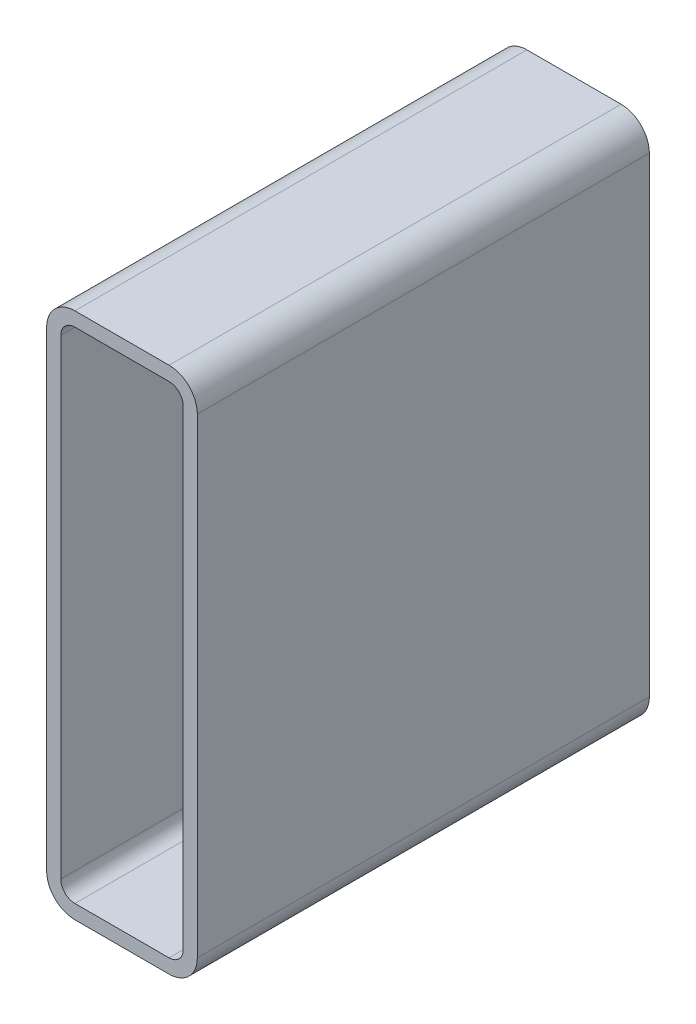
ISO-10303-21;
HEADER;
FILE_DESCRIPTION(('STEP AP214'),'2;1');
FILE_NAME('part.step','',(''),(''),'','','');
FILE_SCHEMA(('AUTOMOTIVE_DESIGN { 1 0 10303 214 1 1 1 1 }'));
ENDSEC;
DATA;
#1=APPLICATION_CONTEXT('core data for automotive mechanical design processes');
#2=APPLICATION_PROTOCOL_DEFINITION('international standard','automotive_design',2000,#1);
#3=PRODUCT_CONTEXT('',#1,'mechanical');
#4=PRODUCT('Part','Part','',(#3));
#5=PRODUCT_RELATED_PRODUCT_CATEGORY('part','',(#4));
#6=PRODUCT_DEFINITION_FORMATION('','',#4);
#7=PRODUCT_DEFINITION_CONTEXT('part definition',#1,'design');
#8=PRODUCT_DEFINITION('design','',#6,#7);
#9=PRODUCT_DEFINITION_SHAPE('','',#8);
#10=(LENGTH_UNIT() NAMED_UNIT(*) SI_UNIT(.MILLI.,.METRE.));
#11=(NAMED_UNIT(*) PLANE_ANGLE_UNIT() SI_UNIT($,.RADIAN.));
#12=(NAMED_UNIT(*) SI_UNIT($,.STERADIAN.) SOLID_ANGLE_UNIT());
#13=UNCERTAINTY_MEASURE_WITH_UNIT(LENGTH_MEASURE(1.E-05),#10,'distance_accuracy_value','');
#14=(GEOMETRIC_REPRESENTATION_CONTEXT(3) GLOBAL_UNCERTAINTY_ASSIGNED_CONTEXT((#13)) GLOBAL_UNIT_ASSIGNED_CONTEXT((#10,
#11,#12)) REPRESENTATION_CONTEXT('',''));
#15=CARTESIAN_POINT('',(0.,0.,0.));
#16=DIRECTION('',(0.,0.,1.));
#17=DIRECTION('',(1.,0.,0.));
#18=AXIS2_PLACEMENT_3D('',#15,#16,#17);
#19=CARTESIAN_POINT('',(20.7251778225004,338.378679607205,304.8));
#20=DIRECTION('',(0.,0.,1.));
#21=DIRECTION('',(1.,0.,0.));
#22=AXIS2_PLACEMENT_3D('',#19,#20,#21);
#23=PLANE('',#22);
#24=CARTESIAN_POINT('',(20.7251778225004,338.378679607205,304.8));
#25=DIRECTION('',(0.,0.,1.));
#26=DIRECTION('',(1.,0.,0.));
#27=AXIS2_PLACEMENT_3D('',#24,#25,#26);
#28=CIRCLE('',#27,19.05);
#29=CARTESIAN_POINT('',(20.7251778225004,357.428679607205,304.8));
#30=VERTEX_POINT('',#29);
#31=CARTESIAN_POINT('',(1.67517782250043,338.378679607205,304.8));
#32=VERTEX_POINT('',#31);
#33=EDGE_CURVE('E211',#30,#32,#28,.T.);
#34=ORIENTED_EDGE('',*,*,#33,.T.);
#35=DIRECTION('',(0.,-1.,0.));
#36=VECTOR('',#35,1.);
#37=CARTESIAN_POINT('',(1.67517782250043,20.8786796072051,304.8));
#38=LINE('',#37,#36);
#39=CARTESIAN_POINT('',(1.67517782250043,20.8786796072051,304.8));
#40=VERTEX_POINT('',#39);
#41=EDGE_CURVE('E214',#32,#40,#38,.T.);
#42=ORIENTED_EDGE('',*,*,#41,.T.);
#43=CARTESIAN_POINT('',(20.7251778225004,20.8786796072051,304.8));
#44=DIRECTION('',(0.,0.,1.));
#45=DIRECTION('',(1.,0.,0.));
#46=AXIS2_PLACEMENT_3D('',#43,#44,#45);
#47=CIRCLE('',#46,19.05);
#48=CARTESIAN_POINT('',(20.7251778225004,1.82867960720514,304.8));
#49=VERTEX_POINT('',#48);
#50=EDGE_CURVE('E217',#40,#49,#47,.T.);
#51=ORIENTED_EDGE('',*,*,#50,.T.);
#52=DIRECTION('',(1.,0.,0.));
#53=VECTOR('',#52,1.);
#54=CARTESIAN_POINT('',(84.2251778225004,1.82867960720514,304.8));
#55=LINE('',#54,#53);
#56=CARTESIAN_POINT('',(84.2251778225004,1.82867960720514,304.8));
#57=VERTEX_POINT('',#56);
#58=EDGE_CURVE('E219',#49,#57,#55,.T.);
#59=ORIENTED_EDGE('',*,*,#58,.T.);
#60=CARTESIAN_POINT('',(84.2251778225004,20.8786796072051,304.8));
#61=DIRECTION('',(0.,0.,1.));
#62=DIRECTION('',(1.,0.,0.));
#63=AXIS2_PLACEMENT_3D('',#60,#61,#62);
#64=CIRCLE('',#63,19.05);
#65=CARTESIAN_POINT('',(103.2751778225,20.8786796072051,304.8));
#66=VERTEX_POINT('',#65);
#67=EDGE_CURVE('E221',#57,#66,#64,.T.);
#68=ORIENTED_EDGE('',*,*,#67,.T.);
#69=DIRECTION('',(0.,1.,0.));
#70=VECTOR('',#69,1.);
#71=CARTESIAN_POINT('',(103.2751778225,338.378679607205,304.8));
#72=LINE('',#71,#70);
#73=CARTESIAN_POINT('',(103.2751778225,338.378679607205,304.8));
#74=VERTEX_POINT('',#73);
#75=EDGE_CURVE('E223',#66,#74,#72,.T.);
#76=ORIENTED_EDGE('',*,*,#75,.T.);
#77=CARTESIAN_POINT('',(84.2251778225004,338.378679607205,304.8));
#78=DIRECTION('',(0.,0.,1.));
#79=DIRECTION('',(1.,0.,0.));
#80=AXIS2_PLACEMENT_3D('',#77,#78,#79);
#81=CIRCLE('',#80,19.05);
#82=CARTESIAN_POINT('',(84.2251778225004,357.428679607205,304.8));
#83=VERTEX_POINT('',#82);
#84=EDGE_CURVE('E225',#74,#83,#81,.T.);
#85=ORIENTED_EDGE('',*,*,#84,.T.);
#86=DIRECTION('',(-1.,0.,0.));
#87=VECTOR('',#86,1.);
#88=CARTESIAN_POINT('',(20.7251778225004,357.428679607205,304.8));
#89=LINE('',#88,#87);
#90=EDGE_CURVE('E227',#83,#30,#89,.T.);
#91=ORIENTED_EDGE('',*,*,#90,.T.);
#92=EDGE_LOOP('',(#34,#42,#51,#59,#68,#76,#85,#91));
#93=FACE_BOUND('',#92,.T.);
#94=DIRECTION('',(0.,-1.,0.));
#95=VECTOR('',#94,1.);
#96=CARTESIAN_POINT('',(11.2001778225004,20.8786796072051,304.8));
#97=LINE('',#96,#95);
#98=CARTESIAN_POINT('',(11.2001778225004,338.378679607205,304.8));
#99=VERTEX_POINT('',#98);
#100=CARTESIAN_POINT('',(11.2001778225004,20.8786796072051,304.8));
#101=VERTEX_POINT('',#100);
#102=EDGE_CURVE('E154',#99,#101,#97,.T.);
#103=ORIENTED_EDGE('',*,*,#102,.F.);
#104=CARTESIAN_POINT('',(20.7251778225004,338.378679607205,304.8));
#105=DIRECTION('',(0.,0.,1.));
#106=DIRECTION('',(1.,0.,0.));
#107=AXIS2_PLACEMENT_3D('',#104,#105,#106);
#108=CIRCLE('',#107,9.52499999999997);
#109=CARTESIAN_POINT('',(20.7251778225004,347.903679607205,304.8));
#110=VERTEX_POINT('',#109);
#111=EDGE_CURVE('E146',#110,#99,#108,.T.);
#112=ORIENTED_EDGE('',*,*,#111,.F.);
#113=DIRECTION('',(-1.,0.,0.));
#114=VECTOR('',#113,1.);
#115=CARTESIAN_POINT('',(20.7251778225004,347.903679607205,304.8));
#116=LINE('',#115,#114);
#117=CARTESIAN_POINT('',(84.2251778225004,347.903679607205,304.8));
#118=VERTEX_POINT('',#117);
#119=EDGE_CURVE('E179',#118,#110,#116,.T.);
#120=ORIENTED_EDGE('',*,*,#119,.F.);
#121=CARTESIAN_POINT('',(84.2251778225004,338.378679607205,304.8));
#122=DIRECTION('',(0.,0.,1.));
#123=DIRECTION('',(1.,0.,0.));
#124=AXIS2_PLACEMENT_3D('',#121,#122,#123);
#125=CIRCLE('',#124,9.52499999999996);
#126=CARTESIAN_POINT('',(93.7501778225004,338.378679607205,304.8));
#127=VERTEX_POINT('',#126);
#128=EDGE_CURVE('E177',#127,#118,#125,.T.);
#129=ORIENTED_EDGE('',*,*,#128,.F.);
#130=DIRECTION('',(0.,1.,0.));
#131=VECTOR('',#130,1.);
#132=CARTESIAN_POINT('',(93.7501778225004,338.378679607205,304.8));
#133=LINE('',#132,#131);
#134=CARTESIAN_POINT('',(93.7501778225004,20.8786796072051,304.8));
#135=VERTEX_POINT('',#134);
#136=EDGE_CURVE('E175',#135,#127,#133,.T.);
#137=ORIENTED_EDGE('',*,*,#136,.F.);
#138=CARTESIAN_POINT('',(84.2251778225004,20.8786796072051,304.8));
#139=DIRECTION('',(0.,0.,1.));
#140=DIRECTION('',(1.,0.,0.));
#141=AXIS2_PLACEMENT_3D('',#138,#139,#140);
#142=CIRCLE('',#141,9.52500000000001);
#143=CARTESIAN_POINT('',(84.2251778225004,11.3536796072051,304.8));
#144=VERTEX_POINT('',#143);
#145=EDGE_CURVE('E173',#144,#135,#142,.T.);
#146=ORIENTED_EDGE('',*,*,#145,.F.);
#147=DIRECTION('',(1.,0.,0.));
#148=VECTOR('',#147,1.);
#149=CARTESIAN_POINT('',(84.2251778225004,11.3536796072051,304.8));
#150=LINE('',#149,#148);
#151=CARTESIAN_POINT('',(20.7251778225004,11.3536796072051,304.8));
#152=VERTEX_POINT('',#151);
#153=EDGE_CURVE('E169',#152,#144,#150,.T.);
#154=ORIENTED_EDGE('',*,*,#153,.F.);
#155=CARTESIAN_POINT('',(20.7251778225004,20.8786796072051,304.8));
#156=DIRECTION('',(0.,0.,1.));
#157=DIRECTION('',(1.,0.,0.));
#158=AXIS2_PLACEMENT_3D('',#155,#156,#157);
#159=CIRCLE('',#158,9.525);
#160=EDGE_CURVE('E167',#101,#152,#159,.T.);
#161=ORIENTED_EDGE('',*,*,#160,.F.);
#162=EDGE_LOOP('',(#103,#112,#120,#129,#137,#146,#154,#161));
#163=FACE_BOUND('',#162,.T.);
#164=ADVANCED_FACE('F33',(#93,#163),#23,.T.);
#165=CARTESIAN_POINT('',(20.7251778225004,338.378679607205,0.));
#166=DIRECTION('',(0.,0.,1.));
#167=DIRECTION('',(1.,0.,0.));
#168=AXIS2_PLACEMENT_3D('',#165,#166,#167);
#169=PLANE('',#168);
#170=CARTESIAN_POINT('',(20.7251778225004,338.378679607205,0.));
#171=DIRECTION('',(0.,0.,1.));
#172=DIRECTION('',(1.,0.,0.));
#173=AXIS2_PLACEMENT_3D('',#170,#171,#172);
#174=CIRCLE('',#173,19.05);
#175=CARTESIAN_POINT('',(20.7251778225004,357.428679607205,0.));
#176=VERTEX_POINT('',#175);
#177=CARTESIAN_POINT('',(1.67517782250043,338.378679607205,0.));
#178=VERTEX_POINT('',#177);
#179=EDGE_CURVE('E162',#176,#178,#174,.T.);
#180=ORIENTED_EDGE('',*,*,#179,.F.);
#181=DIRECTION('',(-1.,0.,0.));
#182=VECTOR('',#181,1.);
#183=CARTESIAN_POINT('',(20.7251778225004,357.428679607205,0.));
#184=LINE('',#183,#182);
#185=CARTESIAN_POINT('',(84.2251778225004,357.428679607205,0.));
#186=VERTEX_POINT('',#185);
#187=EDGE_CURVE('E215',#186,#176,#184,.T.);
#188=ORIENTED_EDGE('',*,*,#187,.F.);
#189=CARTESIAN_POINT('',(84.2251778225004,338.378679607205,0.));
#190=DIRECTION('',(0.,0.,1.));
#191=DIRECTION('',(1.,0.,0.));
#192=AXIS2_PLACEMENT_3D('',#189,#190,#191);
#193=CIRCLE('',#192,19.05);
#194=CARTESIAN_POINT('',(103.2751778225,338.378679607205,0.));
#195=VERTEX_POINT('',#194);
#196=EDGE_CURVE('E242',#195,#186,#193,.T.);
#197=ORIENTED_EDGE('',*,*,#196,.F.);
#198=DIRECTION('',(0.,1.,0.));
#199=VECTOR('',#198,1.);
#200=CARTESIAN_POINT('',(103.2751778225,338.378679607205,0.));
#201=LINE('',#200,#199);
#202=CARTESIAN_POINT('',(103.2751778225,20.8786796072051,0.));
#203=VERTEX_POINT('',#202);
#204=EDGE_CURVE('E240',#203,#195,#201,.T.);
#205=ORIENTED_EDGE('',*,*,#204,.F.);
#206=CARTESIAN_POINT('',(84.2251778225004,20.8786796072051,0.));
#207=DIRECTION('',(0.,0.,1.));
#208=DIRECTION('',(1.,0.,0.));
#209=AXIS2_PLACEMENT_3D('',#206,#207,#208);
#210=CIRCLE('',#209,19.05);
#211=CARTESIAN_POINT('',(84.2251778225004,1.82867960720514,0.));
#212=VERTEX_POINT('',#211);
#213=EDGE_CURVE('E238',#212,#203,#210,.T.);
#214=ORIENTED_EDGE('',*,*,#213,.F.);
#215=DIRECTION('',(1.,0.,0.));
#216=VECTOR('',#215,1.);
#217=CARTESIAN_POINT('',(84.2251778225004,1.82867960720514,0.));
#218=LINE('',#217,#216);
#219=CARTESIAN_POINT('',(20.7251778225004,1.82867960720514,0.));
#220=VERTEX_POINT('',#219);
#221=EDGE_CURVE('E236',#220,#212,#218,.T.);
#222=ORIENTED_EDGE('',*,*,#221,.F.);
#223=CARTESIAN_POINT('',(20.7251778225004,20.8786796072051,0.));
#224=DIRECTION('',(0.,0.,1.));
#225=DIRECTION('',(1.,0.,0.));
#226=AXIS2_PLACEMENT_3D('',#223,#224,#225);
#227=CIRCLE('',#226,19.05);
#228=CARTESIAN_POINT('',(1.67517782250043,20.8786796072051,0.));
#229=VERTEX_POINT('',#228);
#230=EDGE_CURVE('E234',#229,#220,#227,.T.);
#231=ORIENTED_EDGE('',*,*,#230,.F.);
#232=DIRECTION('',(0.,-1.,0.));
#233=VECTOR('',#232,1.);
#234=CARTESIAN_POINT('',(1.67517782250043,20.8786796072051,0.));
#235=LINE('',#234,#233);
#236=EDGE_CURVE('E232',#178,#229,#235,.T.);
#237=ORIENTED_EDGE('',*,*,#236,.F.);
#238=EDGE_LOOP('',(#180,#188,#197,#205,#214,#222,#231,#237));
#239=FACE_BOUND('',#238,.T.);
#240=CARTESIAN_POINT('',(20.7251778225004,338.378679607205,0.));
#241=DIRECTION('',(0.,0.,1.));
#242=DIRECTION('',(1.,0.,0.));
#243=AXIS2_PLACEMENT_3D('',#240,#241,#242);
#244=CIRCLE('',#243,9.52499999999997);
#245=CARTESIAN_POINT('',(20.7251778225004,347.903679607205,0.));
#246=VERTEX_POINT('',#245);
#247=CARTESIAN_POINT('',(11.2001778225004,338.378679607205,0.));
#248=VERTEX_POINT('',#247);
#249=EDGE_CURVE('E56',#246,#248,#244,.T.);
#250=ORIENTED_EDGE('',*,*,#249,.T.);
#251=DIRECTION('',(0.,-1.,0.));
#252=VECTOR('',#251,1.);
#253=CARTESIAN_POINT('',(11.2001778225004,20.8786796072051,0.));
#254=LINE('',#253,#252);
#255=CARTESIAN_POINT('',(11.2001778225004,20.8786796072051,0.));
#256=VERTEX_POINT('',#255);
#257=EDGE_CURVE('E161',#248,#256,#254,.T.);
#258=ORIENTED_EDGE('',*,*,#257,.T.);
#259=CARTESIAN_POINT('',(20.7251778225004,20.8786796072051,0.));
#260=DIRECTION('',(0.,0.,1.));
#261=DIRECTION('',(1.,0.,0.));
#262=AXIS2_PLACEMENT_3D('',#259,#260,#261);
#263=CIRCLE('',#262,9.525);
#264=CARTESIAN_POINT('',(20.7251778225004,11.3536796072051,0.));
#265=VERTEX_POINT('',#264);
#266=EDGE_CURVE('E183',#256,#265,#263,.T.);
#267=ORIENTED_EDGE('',*,*,#266,.T.);
#268=DIRECTION('',(1.,0.,0.));
#269=VECTOR('',#268,1.);
#270=CARTESIAN_POINT('',(84.2251778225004,11.3536796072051,0.));
#271=LINE('',#270,#269);
#272=CARTESIAN_POINT('',(84.2251778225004,11.3536796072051,0.));
#273=VERTEX_POINT('',#272);
#274=EDGE_CURVE('E186',#265,#273,#271,.T.);
#275=ORIENTED_EDGE('',*,*,#274,.T.);
#276=CARTESIAN_POINT('',(84.2251778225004,20.8786796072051,0.));
#277=DIRECTION('',(0.,0.,1.));
#278=DIRECTION('',(1.,0.,0.));
#279=AXIS2_PLACEMENT_3D('',#276,#277,#278);
#280=CIRCLE('',#279,9.52500000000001);
#281=CARTESIAN_POINT('',(93.7501778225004,20.8786796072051,0.));
#282=VERTEX_POINT('',#281);
#283=EDGE_CURVE('E189',#273,#282,#280,.T.);
#284=ORIENTED_EDGE('',*,*,#283,.T.);
#285=DIRECTION('',(0.,1.,0.));
#286=VECTOR('',#285,1.);
#287=CARTESIAN_POINT('',(93.7501778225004,338.378679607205,0.));
#288=LINE('',#287,#286);
#289=CARTESIAN_POINT('',(93.7501778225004,338.378679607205,0.));
#290=VERTEX_POINT('',#289);
#291=EDGE_CURVE('E192',#282,#290,#288,.T.);
#292=ORIENTED_EDGE('',*,*,#291,.T.);
#293=CARTESIAN_POINT('',(84.2251778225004,338.378679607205,0.));
#294=DIRECTION('',(0.,0.,1.));
#295=DIRECTION('',(1.,0.,0.));
#296=AXIS2_PLACEMENT_3D('',#293,#294,#295);
#297=CIRCLE('',#296,9.52499999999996);
#298=CARTESIAN_POINT('',(84.2251778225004,347.903679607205,0.));
#299=VERTEX_POINT('',#298);
#300=EDGE_CURVE('E195',#290,#299,#297,.T.);
#301=ORIENTED_EDGE('',*,*,#300,.T.);
#302=DIRECTION('',(-1.,0.,0.));
#303=VECTOR('',#302,1.);
#304=CARTESIAN_POINT('',(20.7251778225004,347.903679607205,0.));
#305=LINE('',#304,#303);
#306=EDGE_CURVE('E155',#299,#246,#305,.T.);
#307=ORIENTED_EDGE('',*,*,#306,.T.);
#308=EDGE_LOOP('',(#250,#258,#267,#275,#284,#292,#301,#307));
#309=FACE_BOUND('',#308,.T.);
#310=ADVANCED_FACE('F272',(#239,#309),#169,.F.);
#311=CARTESIAN_POINT('',(20.7251778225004,338.378679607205,304.8));
#312=DIRECTION('',(0.,0.,-1.));
#313=DIRECTION('',(-1.,0.,0.));
#314=AXIS2_PLACEMENT_3D('',#311,#312,#313);
#315=CYLINDRICAL_SURFACE('',#314,19.05);
#316=ORIENTED_EDGE('',*,*,#179,.T.);
#317=DIRECTION('',(0.,0.,-1.));
#318=VECTOR('',#317,1.);
#319=CARTESIAN_POINT('',(1.67517782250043,338.378679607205,304.8));
#320=LINE('',#319,#318);
#321=EDGE_CURVE('E11',#32,#178,#320,.T.);
#322=ORIENTED_EDGE('',*,*,#321,.F.);
#323=ORIENTED_EDGE('',*,*,#33,.F.);
#324=DIRECTION('',(0.,0.,-1.));
#325=VECTOR('',#324,1.);
#326=CARTESIAN_POINT('',(20.7251778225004,357.428679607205,304.8));
#327=LINE('',#326,#325);
#328=EDGE_CURVE('E229',#30,#176,#327,.T.);
#329=ORIENTED_EDGE('',*,*,#328,.T.);
#330=EDGE_LOOP('',(#316,#322,#323,#329));
#331=FACE_BOUND('',#330,.T.);
#332=ADVANCED_FACE('F35',(#331),#315,.T.);
#333=CARTESIAN_POINT('',(1.67517782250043,20.8786796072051,304.8));
#334=DIRECTION('',(1.,0.,0.));
#335=DIRECTION('',(0.,0.,-1.));
#336=AXIS2_PLACEMENT_3D('',#333,#334,#335);
#337=PLANE('',#336);
#338=ORIENTED_EDGE('',*,*,#236,.T.);
#339=DIRECTION('',(0.,0.,-1.));
#340=VECTOR('',#339,1.);
#341=CARTESIAN_POINT('',(1.67517782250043,20.8786796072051,304.8));
#342=LINE('',#341,#340);
#343=EDGE_CURVE('E41',#40,#229,#342,.T.);
#344=ORIENTED_EDGE('',*,*,#343,.F.);
#345=ORIENTED_EDGE('',*,*,#41,.F.);
#346=ORIENTED_EDGE('',*,*,#321,.T.);
#347=EDGE_LOOP('',(#338,#344,#345,#346));
#348=FACE_BOUND('',#347,.T.);
#349=ADVANCED_FACE('F289',(#348),#337,.F.);
#350=CARTESIAN_POINT('',(20.7251778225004,20.8786796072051,304.8));
#351=DIRECTION('',(0.,0.,-1.));
#352=DIRECTION('',(-1.,0.,0.));
#353=AXIS2_PLACEMENT_3D('',#350,#351,#352);
#354=CYLINDRICAL_SURFACE('',#353,19.05);
#355=ORIENTED_EDGE('',*,*,#230,.T.);
#356=DIRECTION('',(0.,0.,-1.));
#357=VECTOR('',#356,1.);
#358=CARTESIAN_POINT('',(20.7251778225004,1.82867960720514,304.8));
#359=LINE('',#358,#357);
#360=EDGE_CURVE('E259',#49,#220,#359,.T.);
#361=ORIENTED_EDGE('',*,*,#360,.F.);
#362=ORIENTED_EDGE('',*,*,#50,.F.);
#363=ORIENTED_EDGE('',*,*,#343,.T.);
#364=EDGE_LOOP('',(#355,#361,#362,#363));
#365=FACE_BOUND('',#364,.T.);
#366=ADVANCED_FACE('F266',(#365),#354,.T.);
#367=CARTESIAN_POINT('',(84.2251778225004,1.82867960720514,304.8));
#368=DIRECTION('',(0.,1.,0.));
#369=DIRECTION('',(0.,0.,1.));
#370=AXIS2_PLACEMENT_3D('',#367,#368,#369);
#371=PLANE('',#370);
#372=ORIENTED_EDGE('',*,*,#221,.T.);
#373=DIRECTION('',(0.,0.,-1.));
#374=VECTOR('',#373,1.);
#375=CARTESIAN_POINT('',(84.2251778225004,1.82867960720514,304.8));
#376=LINE('',#375,#374);
#377=EDGE_CURVE('E256',#57,#212,#376,.T.);
#378=ORIENTED_EDGE('',*,*,#377,.F.);
#379=ORIENTED_EDGE('',*,*,#58,.F.);
#380=ORIENTED_EDGE('',*,*,#360,.T.);
#381=EDGE_LOOP('',(#372,#378,#379,#380));
#382=FACE_BOUND('',#381,.T.);
#383=ADVANCED_FACE('F278',(#382),#371,.F.);
#384=CARTESIAN_POINT('',(84.2251778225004,20.8786796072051,304.8));
#385=DIRECTION('',(0.,0.,-1.));
#386=DIRECTION('',(-1.,0.,0.));
#387=AXIS2_PLACEMENT_3D('',#384,#385,#386);
#388=CYLINDRICAL_SURFACE('',#387,19.05);
#389=ORIENTED_EDGE('',*,*,#213,.T.);
#390=DIRECTION('',(0.,0.,-1.));
#391=VECTOR('',#390,1.);
#392=CARTESIAN_POINT('',(103.2751778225,20.8786796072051,304.8));
#393=LINE('',#392,#391);
#394=EDGE_CURVE('E253',#66,#203,#393,.T.);
#395=ORIENTED_EDGE('',*,*,#394,.F.);
#396=ORIENTED_EDGE('',*,*,#67,.F.);
#397=ORIENTED_EDGE('',*,*,#377,.T.);
#398=EDGE_LOOP('',(#389,#395,#396,#397));
#399=FACE_BOUND('',#398,.T.);
#400=ADVANCED_FACE('F282',(#399),#388,.T.);
#401=CARTESIAN_POINT('',(103.2751778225,338.378679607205,304.8));
#402=DIRECTION('',(-1.,0.,0.));
#403=DIRECTION('',(0.,0.,1.));
#404=AXIS2_PLACEMENT_3D('',#401,#402,#403);
#405=PLANE('',#404);
#406=ORIENTED_EDGE('',*,*,#204,.T.);
#407=DIRECTION('',(0.,0.,-1.));
#408=VECTOR('',#407,1.);
#409=CARTESIAN_POINT('',(103.2751778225,338.378679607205,304.8));
#410=LINE('',#409,#408);
#411=EDGE_CURVE('E250',#74,#195,#410,.T.);
#412=ORIENTED_EDGE('',*,*,#411,.F.);
#413=ORIENTED_EDGE('',*,*,#75,.F.);
#414=ORIENTED_EDGE('',*,*,#394,.T.);
#415=EDGE_LOOP('',(#406,#412,#413,#414));
#416=FACE_BOUND('',#415,.T.);
#417=ADVANCED_FACE('F302',(#416),#405,.F.);
#418=CARTESIAN_POINT('',(84.2251778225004,338.378679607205,304.8));
#419=DIRECTION('',(0.,0.,-1.));
#420=DIRECTION('',(-1.,0.,0.));
#421=AXIS2_PLACEMENT_3D('',#418,#419,#420);
#422=CYLINDRICAL_SURFACE('',#421,19.05);
#423=ORIENTED_EDGE('',*,*,#196,.T.);
#424=DIRECTION('',(0.,0.,-1.));
#425=VECTOR('',#424,1.);
#426=CARTESIAN_POINT('',(84.2251778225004,357.428679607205,304.8));
#427=LINE('',#426,#425);
#428=EDGE_CURVE('E247',#83,#186,#427,.T.);
#429=ORIENTED_EDGE('',*,*,#428,.F.);
#430=ORIENTED_EDGE('',*,*,#84,.F.);
#431=ORIENTED_EDGE('',*,*,#411,.T.);
#432=EDGE_LOOP('',(#423,#429,#430,#431));
#433=FACE_BOUND('',#432,.T.);
#434=ADVANCED_FACE('F300',(#433),#422,.T.);
#435=CARTESIAN_POINT('',(20.7251778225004,357.428679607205,304.8));
#436=DIRECTION('',(0.,-1.,0.));
#437=DIRECTION('',(0.,0.,-1.));
#438=AXIS2_PLACEMENT_3D('',#435,#436,#437);
#439=PLANE('',#438);
#440=ORIENTED_EDGE('',*,*,#187,.T.);
#441=ORIENTED_EDGE('',*,*,#328,.F.);
#442=ORIENTED_EDGE('',*,*,#90,.F.);
#443=ORIENTED_EDGE('',*,*,#428,.T.);
#444=EDGE_LOOP('',(#440,#441,#442,#443));
#445=FACE_BOUND('',#444,.T.);
#446=ADVANCED_FACE('F295',(#445),#439,.F.);
#447=CARTESIAN_POINT('',(20.7251778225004,338.378679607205,304.8));
#448=DIRECTION('',(0.,0.,-1.));
#449=DIRECTION('',(-1.,0.,0.));
#450=AXIS2_PLACEMENT_3D('',#447,#448,#449);
#451=CYLINDRICAL_SURFACE('',#450,9.52499999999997);
#452=ORIENTED_EDGE('',*,*,#249,.F.);
#453=DIRECTION('',(0.,0.,-1.));
#454=VECTOR('',#453,1.);
#455=CARTESIAN_POINT('',(20.7251778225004,347.903679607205,304.8));
#456=LINE('',#455,#454);
#457=EDGE_CURVE('E150',#110,#246,#456,.T.);
#458=ORIENTED_EDGE('',*,*,#457,.F.);
#459=ORIENTED_EDGE('',*,*,#111,.T.);
#460=DIRECTION('',(0.,0.,-1.));
#461=VECTOR('',#460,1.);
#462=CARTESIAN_POINT('',(11.2001778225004,338.378679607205,304.8));
#463=LINE('',#462,#461);
#464=EDGE_CURVE('E149',#99,#248,#463,.T.);
#465=ORIENTED_EDGE('',*,*,#464,.T.);
#466=EDGE_LOOP('',(#452,#458,#459,#465));
#467=FACE_BOUND('',#466,.T.);
#468=ADVANCED_FACE('F148',(#467),#451,.F.);
#469=CARTESIAN_POINT('',(11.2001778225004,20.8786796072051,304.8));
#470=DIRECTION('',(1.,0.,0.));
#471=DIRECTION('',(0.,0.,-1.));
#472=AXIS2_PLACEMENT_3D('',#469,#470,#471);
#473=PLANE('',#472);
#474=ORIENTED_EDGE('',*,*,#257,.F.);
#475=ORIENTED_EDGE('',*,*,#464,.F.);
#476=ORIENTED_EDGE('',*,*,#102,.T.);
#477=DIRECTION('',(0.,0.,-1.));
#478=VECTOR('',#477,1.);
#479=CARTESIAN_POINT('',(11.2001778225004,20.8786796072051,304.8));
#480=LINE('',#479,#478);
#481=EDGE_CURVE('E163',#101,#256,#480,.T.);
#482=ORIENTED_EDGE('',*,*,#481,.T.);
#483=EDGE_LOOP('',(#474,#475,#476,#482));
#484=FACE_BOUND('',#483,.T.);
#485=ADVANCED_FACE('F158',(#484),#473,.T.);
#486=CARTESIAN_POINT('',(20.7251778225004,20.8786796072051,304.8));
#487=DIRECTION('',(0.,0.,-1.));
#488=DIRECTION('',(-1.,0.,0.));
#489=AXIS2_PLACEMENT_3D('',#486,#487,#488);
#490=CYLINDRICAL_SURFACE('',#489,9.525);
#491=ORIENTED_EDGE('',*,*,#266,.F.);
#492=ORIENTED_EDGE('',*,*,#481,.F.);
#493=ORIENTED_EDGE('',*,*,#160,.T.);
#494=DIRECTION('',(0.,0.,-1.));
#495=VECTOR('',#494,1.);
#496=CARTESIAN_POINT('',(20.7251778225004,11.3536796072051,304.8));
#497=LINE('',#496,#495);
#498=EDGE_CURVE('E208',#152,#265,#497,.T.);
#499=ORIENTED_EDGE('',*,*,#498,.T.);
#500=EDGE_LOOP('',(#491,#492,#493,#499));
#501=FACE_BOUND('',#500,.T.);
#502=ADVANCED_FACE('F327',(#501),#490,.F.);
#503=CARTESIAN_POINT('',(84.2251778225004,11.3536796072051,304.8));
#504=DIRECTION('',(0.,1.,0.));
#505=DIRECTION('',(0.,0.,1.));
#506=AXIS2_PLACEMENT_3D('',#503,#504,#505);
#507=PLANE('',#506);
#508=ORIENTED_EDGE('',*,*,#274,.F.);
#509=ORIENTED_EDGE('',*,*,#498,.F.);
#510=ORIENTED_EDGE('',*,*,#153,.T.);
#511=DIRECTION('',(0.,0.,-1.));
#512=VECTOR('',#511,1.);
#513=CARTESIAN_POINT('',(84.2251778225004,11.3536796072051,304.8));
#514=LINE('',#513,#512);
#515=EDGE_CURVE('E206',#144,#273,#514,.T.);
#516=ORIENTED_EDGE('',*,*,#515,.T.);
#517=EDGE_LOOP('',(#508,#509,#510,#516));
#518=FACE_BOUND('',#517,.T.);
#519=ADVANCED_FACE('F331',(#518),#507,.T.);
#520=CARTESIAN_POINT('',(84.2251778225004,20.8786796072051,304.8));
#521=DIRECTION('',(0.,0.,-1.));
#522=DIRECTION('',(-1.,0.,0.));
#523=AXIS2_PLACEMENT_3D('',#520,#521,#522);
#524=CYLINDRICAL_SURFACE('',#523,9.52500000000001);
#525=ORIENTED_EDGE('',*,*,#283,.F.);
#526=ORIENTED_EDGE('',*,*,#515,.F.);
#527=ORIENTED_EDGE('',*,*,#145,.T.);
#528=DIRECTION('',(0.,0.,-1.));
#529=VECTOR('',#528,1.);
#530=CARTESIAN_POINT('',(93.7501778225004,20.8786796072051,304.8));
#531=LINE('',#530,#529);
#532=EDGE_CURVE('E204',#135,#282,#531,.T.);
#533=ORIENTED_EDGE('',*,*,#532,.T.);
#534=EDGE_LOOP('',(#525,#526,#527,#533));
#535=FACE_BOUND('',#534,.T.);
#536=ADVANCED_FACE('F337',(#535),#524,.F.);
#537=CARTESIAN_POINT('',(93.7501778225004,338.378679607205,304.8));
#538=DIRECTION('',(-1.,0.,0.));
#539=DIRECTION('',(0.,0.,1.));
#540=AXIS2_PLACEMENT_3D('',#537,#538,#539);
#541=PLANE('',#540);
#542=ORIENTED_EDGE('',*,*,#291,.F.);
#543=ORIENTED_EDGE('',*,*,#532,.F.);
#544=ORIENTED_EDGE('',*,*,#136,.T.);
#545=DIRECTION('',(0.,0.,-1.));
#546=VECTOR('',#545,1.);
#547=CARTESIAN_POINT('',(93.7501778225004,338.378679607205,304.8));
#548=LINE('',#547,#546);
#549=EDGE_CURVE('E202',#127,#290,#548,.T.);
#550=ORIENTED_EDGE('',*,*,#549,.T.);
#551=EDGE_LOOP('',(#542,#543,#544,#550));
#552=FACE_BOUND('',#551,.T.);
#553=ADVANCED_FACE('F341',(#552),#541,.T.);
#554=CARTESIAN_POINT('',(84.2251778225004,338.378679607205,304.8));
#555=DIRECTION('',(0.,0.,-1.));
#556=DIRECTION('',(-1.,0.,0.));
#557=AXIS2_PLACEMENT_3D('',#554,#555,#556);
#558=CYLINDRICAL_SURFACE('',#557,9.52499999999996);
#559=ORIENTED_EDGE('',*,*,#300,.F.);
#560=ORIENTED_EDGE('',*,*,#549,.F.);
#561=ORIENTED_EDGE('',*,*,#128,.T.);
#562=DIRECTION('',(0.,0.,-1.));
#563=VECTOR('',#562,1.);
#564=CARTESIAN_POINT('',(84.2251778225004,347.903679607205,304.8));
#565=LINE('',#564,#563);
#566=EDGE_CURVE('E48',#118,#299,#565,.T.);
#567=ORIENTED_EDGE('',*,*,#566,.T.);
#568=EDGE_LOOP('',(#559,#560,#561,#567));
#569=FACE_BOUND('',#568,.T.);
#570=ADVANCED_FACE('F345',(#569),#558,.F.);
#571=CARTESIAN_POINT('',(20.7251778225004,347.903679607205,304.8));
#572=DIRECTION('',(0.,-1.,0.));
#573=DIRECTION('',(0.,0.,-1.));
#574=AXIS2_PLACEMENT_3D('',#571,#572,#573);
#575=PLANE('',#574);
#576=ORIENTED_EDGE('',*,*,#306,.F.);
#577=ORIENTED_EDGE('',*,*,#566,.F.);
#578=ORIENTED_EDGE('',*,*,#119,.T.);
#579=ORIENTED_EDGE('',*,*,#457,.T.);
#580=EDGE_LOOP('',(#576,#577,#578,#579));
#581=FACE_BOUND('',#580,.T.);
#582=ADVANCED_FACE('F349',(#581),#575,.T.);
#583=CLOSED_SHELL('',(#164,#310,#332,#349,#366,#383,#400,#417,#434,#446,#468,#485,#502,#519,
#536,#553,#570,#582));
#584=MANIFOLD_SOLID_BREP('B2',#583);
#585=ADVANCED_BREP_SHAPE_REPRESENTATION('',(#18,#584),#14);
#586=SHAPE_DEFINITION_REPRESENTATION(#9,#585);
ENDSEC;
END-ISO-10303-21;
